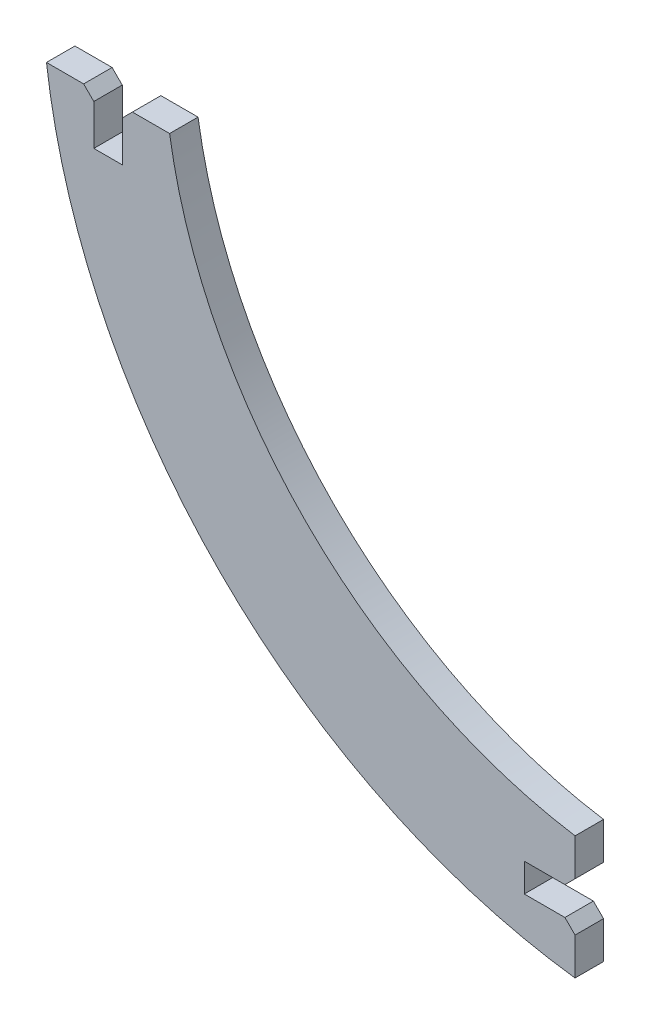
ISO-10303-21;
HEADER;
FILE_DESCRIPTION(('STEP AP214'),'2;1');
FILE_NAME('part.step','',(''),(''),'','','');
FILE_SCHEMA(('AUTOMOTIVE_DESIGN { 1 0 10303 214 1 1 1 1 }'));
ENDSEC;
DATA;
#1=APPLICATION_CONTEXT('core data for automotive mechanical design processes');
#2=APPLICATION_PROTOCOL_DEFINITION('international standard','automotive_design',2000,#1);
#3=PRODUCT_CONTEXT('',#1,'mechanical');
#4=PRODUCT('Part','Part','',(#3));
#5=PRODUCT_RELATED_PRODUCT_CATEGORY('part','',(#4));
#6=PRODUCT_DEFINITION_FORMATION('','',#4);
#7=PRODUCT_DEFINITION_CONTEXT('part definition',#1,'design');
#8=PRODUCT_DEFINITION('design','',#6,#7);
#9=PRODUCT_DEFINITION_SHAPE('','',#8);
#10=(LENGTH_UNIT() NAMED_UNIT(*) SI_UNIT(.MILLI.,.METRE.));
#11=(NAMED_UNIT(*) PLANE_ANGLE_UNIT() SI_UNIT($,.RADIAN.));
#12=(NAMED_UNIT(*) SI_UNIT($,.STERADIAN.) SOLID_ANGLE_UNIT());
#13=UNCERTAINTY_MEASURE_WITH_UNIT(LENGTH_MEASURE(1.E-05),#10,'distance_accuracy_value','');
#14=(GEOMETRIC_REPRESENTATION_CONTEXT(3) GLOBAL_UNCERTAINTY_ASSIGNED_CONTEXT((#13)) GLOBAL_UNIT_ASSIGNED_CONTEXT((#10,
#11,#12)) REPRESENTATION_CONTEXT('',''));
#15=CARTESIAN_POINT('',(0.,0.,0.));
#16=DIRECTION('',(0.,0.,1.));
#17=DIRECTION('',(1.,0.,0.));
#18=AXIS2_PLACEMENT_3D('',#15,#16,#17);
#19=CARTESIAN_POINT('',(-7.49999999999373,-75.9999999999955,-20.9830787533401));
#20=DIRECTION('',(-1.,0.,0.));
#21=DIRECTION('',(0.,-1.,0.));
#22=AXIS2_PLACEMENT_3D('',#19,#20,#21);
#23=PLANE('',#22);
#24=DIRECTION('',(0.,-1.,0.));
#25=VECTOR('',#24,1.);
#26=CARTESIAN_POINT('',(-7.49999999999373,-75.9999999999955,1.4));
#27=LINE('',#26,#25);
#28=CARTESIAN_POINT('',(-7.49999999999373,-63.4104418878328,1.4));
#29=VERTEX_POINT('',#28);
#30=CARTESIAN_POINT('',(-7.49999999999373,-67.0699231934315,1.4));
#31=VERTEX_POINT('',#30);
#32=EDGE_CURVE('E219',#29,#31,#27,.T.);
#33=ORIENTED_EDGE('',*,*,#32,.T.);
#34=DIRECTION('',(0.,0.,-1.));
#35=VECTOR('',#34,1.);
#36=CARTESIAN_POINT('',(-7.49999999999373,-67.0699231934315,-20.9830787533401));
#37=LINE('',#36,#35);
#38=CARTESIAN_POINT('',(-7.49999999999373,-67.0699231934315,-1.4));
#39=VERTEX_POINT('',#38);
#40=EDGE_CURVE('E264',#31,#39,#37,.T.);
#41=ORIENTED_EDGE('',*,*,#40,.T.);
#42=DIRECTION('',(0.,1.,0.));
#43=VECTOR('',#42,1.);
#44=CARTESIAN_POINT('',(-7.49999999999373,-75.9999999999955,-1.4));
#45=LINE('',#44,#43);
#46=CARTESIAN_POINT('',(-7.50000000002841,-63.4104418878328,-1.4));
#47=VERTEX_POINT('',#46);
#48=EDGE_CURVE('E218',#39,#47,#45,.T.);
#49=ORIENTED_EDGE('',*,*,#48,.T.);
#50=DIRECTION('',(0.,0.,1.));
#51=VECTOR('',#50,1.);
#52=CARTESIAN_POINT('',(-7.49999999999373,-63.4104418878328,-20.9830787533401));
#53=LINE('',#52,#51);
#54=EDGE_CURVE('E217',#47,#29,#53,.T.);
#55=ORIENTED_EDGE('',*,*,#54,.T.);
#56=EDGE_LOOP('',(#33,#41,#49,#55));
#57=FACE_BOUND('',#56,.T.);
#58=ADVANCED_FACE('F41',(#57),#23,.F.);
#59=CARTESIAN_POINT('',(-60.,-23.5,-20.9830787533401));
#60=DIRECTION('',(0.,-1.,0.));
#61=DIRECTION('',(0.,0.,-1.));
#62=AXIS2_PLACEMENT_3D('',#59,#60,#61);
#63=PLANE('',#62);
#64=DIRECTION('',(1.,0.,0.));
#65=VECTOR('',#64,1.);
#66=CARTESIAN_POINT('',(-60.,-23.5,1.4));
#67=LINE('',#66,#65);
#68=CARTESIAN_POINT('',(-59.5294044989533,-23.5,1.4));
#69=VERTEX_POINT('',#68);
#70=CARTESIAN_POINT('',(-55.8699231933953,-23.5,1.4));
#71=VERTEX_POINT('',#70);
#72=EDGE_CURVE('E232',#69,#71,#67,.T.);
#73=ORIENTED_EDGE('',*,*,#72,.T.);
#74=DIRECTION('',(0.,0.,-1.));
#75=VECTOR('',#74,1.);
#76=CARTESIAN_POINT('',(-55.8699231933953,-23.5,-20.9830787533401));
#77=LINE('',#76,#75);
#78=CARTESIAN_POINT('',(-55.8699231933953,-23.5,-1.4));
#79=VERTEX_POINT('',#78);
#80=EDGE_CURVE('E269',#71,#79,#77,.T.);
#81=ORIENTED_EDGE('',*,*,#80,.T.);
#82=DIRECTION('',(-1.,0.,0.));
#83=VECTOR('',#82,1.);
#84=CARTESIAN_POINT('',(-60.,-23.5,-1.4));
#85=LINE('',#84,#83);
#86=CARTESIAN_POINT('',(-59.5294044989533,-23.5,-1.4));
#87=VERTEX_POINT('',#86);
#88=EDGE_CURVE('E228',#79,#87,#85,.T.);
#89=ORIENTED_EDGE('',*,*,#88,.T.);
#90=DIRECTION('',(0.,0.,-1.));
#91=VECTOR('',#90,1.);
#92=CARTESIAN_POINT('',(-59.5294044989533,-23.5,1.4));
#93=LINE('',#92,#91);
#94=EDGE_CURVE('E205',#69,#87,#93,.T.);
#95=ORIENTED_EDGE('',*,*,#94,.F.);
#96=EDGE_LOOP('',(#73,#81,#89,#95));
#97=FACE_BOUND('',#96,.T.);
#98=ADVANCED_FACE('F332',(#97),#63,.F.);
#99=CARTESIAN_POINT('',(0.,-16.,1.4));
#100=DIRECTION('',(0.,0.,-1.));
#101=DIRECTION('',(-1.,0.,0.));
#102=AXIS2_PLACEMENT_3D('',#99,#100,#101);
#103=CYLINDRICAL_SURFACE('',#102,48.);
#104=DIRECTION('',(0.,0.,1.));
#105=VECTOR('',#104,1.);
#106=CARTESIAN_POINT('',(-47.4104418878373,-23.5,-20.9830787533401));
#107=LINE('',#106,#105);
#108=CARTESIAN_POINT('',(-47.4104418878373,-23.5,-1.4));
#109=VERTEX_POINT('',#108);
#110=CARTESIAN_POINT('',(-47.4104418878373,-23.5,1.4));
#111=VERTEX_POINT('',#110);
#112=EDGE_CURVE('E229',#109,#111,#107,.T.);
#113=ORIENTED_EDGE('',*,*,#112,.T.);
#114=CARTESIAN_POINT('',(0.,-16.,1.4));
#115=DIRECTION('',(0.,0.,1.));
#116=DIRECTION('',(1.,0.,0.));
#117=AXIS2_PLACEMENT_3D('',#114,#115,#116);
#118=CIRCLE('',#117,48.);
#119=EDGE_CURVE('E209',#111,#29,#118,.T.);
#120=ORIENTED_EDGE('',*,*,#119,.T.);
#121=ORIENTED_EDGE('',*,*,#54,.F.);
#122=CARTESIAN_POINT('',(0.,-16.,-1.4));
#123=DIRECTION('',(0.,0.,1.));
#124=DIRECTION('',(1.,0.,0.));
#125=AXIS2_PLACEMENT_3D('',#122,#123,#124);
#126=CIRCLE('',#125,48.);
#127=EDGE_CURVE('E213',#109,#47,#126,.T.);
#128=ORIENTED_EDGE('',*,*,#127,.F.);
#129=EDGE_LOOP('',(#113,#120,#121,#128));
#130=FACE_BOUND('',#129,.T.);
#131=ADVANCED_FACE('F284',(#130),#103,.F.);
#132=CARTESIAN_POINT('',(0.,-16.,1.4));
#133=DIRECTION('',(0.,0.,-1.));
#134=DIRECTION('',(-1.,0.,0.));
#135=AXIS2_PLACEMENT_3D('',#132,#133,#134);
#136=CYLINDRICAL_SURFACE('',#135,60.);
#137=CARTESIAN_POINT('',(0.,-16.,1.4));
#138=DIRECTION('',(0.,0.,1.));
#139=DIRECTION('',(1.,0.,0.));
#140=AXIS2_PLACEMENT_3D('',#137,#138,#139);
#141=CIRCLE('',#140,60.);
#142=CARTESIAN_POINT('',(-7.49999999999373,-75.5294044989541,1.4));
#143=VERTEX_POINT('',#142);
#144=EDGE_CURVE('E235',#69,#143,#141,.T.);
#145=ORIENTED_EDGE('',*,*,#144,.F.);
#146=ORIENTED_EDGE('',*,*,#94,.T.);
#147=CARTESIAN_POINT('',(0.,-16.,-1.4));
#148=DIRECTION('',(0.,0.,1.));
#149=DIRECTION('',(1.,0.,0.));
#150=AXIS2_PLACEMENT_3D('',#147,#148,#149);
#151=CIRCLE('',#150,60.);
#152=CARTESIAN_POINT('',(-7.49999999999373,-75.5294044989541,-1.4));
#153=VERTEX_POINT('',#152);
#154=EDGE_CURVE('E208',#87,#153,#151,.T.);
#155=ORIENTED_EDGE('',*,*,#154,.T.);
#156=DIRECTION('',(0.,0.,-1.));
#157=VECTOR('',#156,1.);
#158=CARTESIAN_POINT('',(-7.49999999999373,-75.5294044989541,1.4));
#159=LINE('',#158,#157);
#160=EDGE_CURVE('E210',#153,#143,#159,.F.);
#161=ORIENTED_EDGE('',*,*,#160,.T.);
#162=EDGE_LOOP('',(#145,#146,#155,#161));
#163=FACE_BOUND('',#162,.T.);
#164=ADVANCED_FACE('F308',(#163),#136,.T.);
#165=CARTESIAN_POINT('',(0.,-16.,-1.4));
#166=DIRECTION('',(0.,0.,1.));
#167=DIRECTION('',(1.,0.,0.));
#168=AXIS2_PLACEMENT_3D('',#165,#166,#167);
#169=PLANE('',#168);
#170=DIRECTION('',(-1.,0.,0.));
#171=VECTOR('',#170,1.);
#172=CARTESIAN_POINT('',(-7.49999999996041,-70.8699231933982,-1.4));
#173=LINE('',#172,#171);
#174=CARTESIAN_POINT('',(-8.4999999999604,-70.8699231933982,-1.4));
#175=VERTEX_POINT('',#174);
#176=CARTESIAN_POINT('',(-12.4999999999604,-70.8699231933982,-1.4));
#177=VERTEX_POINT('',#176);
#178=EDGE_CURVE('E181',#175,#177,#173,.T.);
#179=ORIENTED_EDGE('',*,*,#178,.F.);
#180=DIRECTION('',(-0.707106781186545,0.707106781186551,0.));
#181=VECTOR('',#180,1.);
#182=CARTESIAN_POINT('',(-7.49999999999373,-71.8699231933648,-1.4));
#183=LINE('',#182,#181);
#184=CARTESIAN_POINT('',(-7.49999999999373,-71.8699231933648,-1.4));
#185=VERTEX_POINT('',#184);
#186=EDGE_CURVE('E260',#175,#185,#183,.F.);
#187=ORIENTED_EDGE('',*,*,#186,.T.);
#188=EDGE_CURVE('E214',#153,#185,#45,.T.);
#189=ORIENTED_EDGE('',*,*,#188,.F.);
#190=ORIENTED_EDGE('',*,*,#154,.F.);
#191=ORIENTED_EDGE('',*,*,#88,.F.);
#192=DIRECTION('',(-0.707106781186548,0.707106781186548,0.));
#193=VECTOR('',#192,1.);
#194=CARTESIAN_POINT('',(-54.8699231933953,-24.5,-1.4));
#195=LINE('',#194,#193);
#196=CARTESIAN_POINT('',(-54.8699231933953,-24.5,-1.4));
#197=VERTEX_POINT('',#196);
#198=EDGE_CURVE('E257',#79,#197,#195,.F.);
#199=ORIENTED_EDGE('',*,*,#198,.T.);
#200=DIRECTION('',(0.,1.,0.));
#201=VECTOR('',#200,1.);
#202=CARTESIAN_POINT('',(-54.8699231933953,-28.5,-1.4));
#203=LINE('',#202,#201);
#204=CARTESIAN_POINT('',(-54.8699231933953,-28.5,-1.4));
#205=VERTEX_POINT('',#204);
#206=EDGE_CURVE('E196',#205,#197,#203,.T.);
#207=ORIENTED_EDGE('',*,*,#206,.F.);
#208=DIRECTION('',(-1.,0.,0.));
#209=VECTOR('',#208,1.);
#210=CARTESIAN_POINT('',(-54.8699231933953,-28.5,-1.4));
#211=LINE('',#210,#209);
#212=CARTESIAN_POINT('',(-52.0699231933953,-28.5,-1.4));
#213=VERTEX_POINT('',#212);
#214=EDGE_CURVE('E189',#213,#205,#211,.T.);
#215=ORIENTED_EDGE('',*,*,#214,.F.);
#216=DIRECTION('',(0.,-1.,0.));
#217=VECTOR('',#216,1.);
#218=CARTESIAN_POINT('',(-52.0699231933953,-28.5,-1.4));
#219=LINE('',#218,#217);
#220=CARTESIAN_POINT('',(-52.0699231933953,-24.5,-1.4));
#221=VERTEX_POINT('',#220);
#222=EDGE_CURVE('E187',#221,#213,#219,.T.);
#223=ORIENTED_EDGE('',*,*,#222,.F.);
#224=DIRECTION('',(-0.70710678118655,-0.707106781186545,0.));
#225=VECTOR('',#224,1.);
#226=CARTESIAN_POINT('',(-51.0699231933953,-23.5,-1.4));
#227=LINE('',#226,#225);
#228=CARTESIAN_POINT('',(-51.0699231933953,-23.5,-1.4));
#229=VERTEX_POINT('',#228);
#230=EDGE_CURVE('E57',#221,#229,#227,.F.);
#231=ORIENTED_EDGE('',*,*,#230,.T.);
#232=EDGE_CURVE('E225',#109,#229,#85,.T.);
#233=ORIENTED_EDGE('',*,*,#232,.F.);
#234=ORIENTED_EDGE('',*,*,#127,.T.);
#235=ORIENTED_EDGE('',*,*,#48,.F.);
#236=DIRECTION('',(0.707106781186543,0.707106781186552,0.));
#237=VECTOR('',#236,1.);
#238=CARTESIAN_POINT('',(-8.49999999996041,-68.0699231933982,-1.4));
#239=LINE('',#238,#237);
#240=CARTESIAN_POINT('',(-8.49999999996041,-68.0699231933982,-1.4));
#241=VERTEX_POINT('',#240);
#242=EDGE_CURVE('E180',#39,#241,#239,.F.);
#243=ORIENTED_EDGE('',*,*,#242,.T.);
#244=DIRECTION('',(1.,0.,0.));
#245=VECTOR('',#244,1.);
#246=CARTESIAN_POINT('',(-7.49999999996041,-68.0699231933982,-1.4));
#247=LINE('',#246,#245);
#248=CARTESIAN_POINT('',(-12.4999999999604,-68.0699231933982,-1.4));
#249=VERTEX_POINT('',#248);
#250=EDGE_CURVE('E165',#249,#241,#247,.T.);
#251=ORIENTED_EDGE('',*,*,#250,.F.);
#252=DIRECTION('',(0.,1.,0.));
#253=VECTOR('',#252,1.);
#254=CARTESIAN_POINT('',(-12.4999999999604,-68.0699231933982,-1.4));
#255=LINE('',#254,#253);
#256=EDGE_CURVE('E156',#177,#249,#255,.T.);
#257=ORIENTED_EDGE('',*,*,#256,.F.);
#258=EDGE_LOOP('',(#179,#187,#189,#190,#191,#199,#207,#215,#223,#231,#233,#234,#235,#243,#251,#257));
#259=FACE_BOUND('',#258,.T.);
#260=ADVANCED_FACE('F177',(#259),#169,.F.);
#261=CARTESIAN_POINT('',(0.,-16.,1.4));
#262=DIRECTION('',(0.,0.,1.));
#263=DIRECTION('',(1.,0.,0.));
#264=AXIS2_PLACEMENT_3D('',#261,#262,#263);
#265=PLANE('',#264);
#266=CARTESIAN_POINT('',(-7.49999999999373,-71.8699231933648,1.4));
#267=VERTEX_POINT('',#266);
#268=EDGE_CURVE('E223',#267,#143,#27,.T.);
#269=ORIENTED_EDGE('',*,*,#268,.F.);
#270=DIRECTION('',(0.707106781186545,-0.707106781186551,0.));
#271=VECTOR('',#270,1.);
#272=CARTESIAN_POINT('',(-31.6849615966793,-47.684961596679,1.4));
#273=LINE('',#272,#271);
#274=CARTESIAN_POINT('',(-8.4999999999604,-70.8699231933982,1.4));
#275=VERTEX_POINT('',#274);
#276=EDGE_CURVE('E252',#267,#275,#273,.F.);
#277=ORIENTED_EDGE('',*,*,#276,.T.);
#278=DIRECTION('',(1.,0.,0.));
#279=VECTOR('',#278,1.);
#280=CARTESIAN_POINT('',(-7.49999999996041,-70.8699231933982,1.4));
#281=LINE('',#280,#279);
#282=CARTESIAN_POINT('',(-12.4999999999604,-70.8699231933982,1.4));
#283=VERTEX_POINT('',#282);
#284=EDGE_CURVE('E175',#283,#275,#281,.T.);
#285=ORIENTED_EDGE('',*,*,#284,.F.);
#286=DIRECTION('',(0.,-1.,0.));
#287=VECTOR('',#286,1.);
#288=CARTESIAN_POINT('',(-12.4999999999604,-68.0699231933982,1.4));
#289=LINE('',#288,#287);
#290=CARTESIAN_POINT('',(-12.4999999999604,-68.0699231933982,1.4));
#291=VERTEX_POINT('',#290);
#292=EDGE_CURVE('E291',#291,#283,#289,.T.);
#293=ORIENTED_EDGE('',*,*,#292,.F.);
#294=DIRECTION('',(-1.,0.,0.));
#295=VECTOR('',#294,1.);
#296=CARTESIAN_POINT('',(-7.49999999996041,-68.0699231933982,1.4));
#297=LINE('',#296,#295);
#298=CARTESIAN_POINT('',(-8.49999999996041,-68.0699231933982,1.4));
#299=VERTEX_POINT('',#298);
#300=EDGE_CURVE('E174',#299,#291,#297,.T.);
#301=ORIENTED_EDGE('',*,*,#300,.F.);
#302=DIRECTION('',(-0.707106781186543,-0.707106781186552,0.));
#303=VECTOR('',#302,1.);
#304=CARTESIAN_POINT('',(21.7849615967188,-37.7849615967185,1.4));
#305=LINE('',#304,#303);
#306=EDGE_CURVE('E250',#299,#31,#305,.F.);
#307=ORIENTED_EDGE('',*,*,#306,.T.);
#308=ORIENTED_EDGE('',*,*,#32,.F.);
#309=ORIENTED_EDGE('',*,*,#119,.F.);
#310=CARTESIAN_POINT('',(-51.0699231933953,-23.5,1.4));
#311=VERTEX_POINT('',#310);
#312=EDGE_CURVE('E222',#311,#111,#67,.T.);
#313=ORIENTED_EDGE('',*,*,#312,.F.);
#314=DIRECTION('',(0.70710678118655,0.707106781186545,0.));
#315=VECTOR('',#314,1.);
#316=CARTESIAN_POINT('',(-21.7849615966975,5.78496159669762,1.4));
#317=LINE('',#316,#315);
#318=CARTESIAN_POINT('',(-52.0699231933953,-24.5,1.4));
#319=VERTEX_POINT('',#318);
#320=EDGE_CURVE('E246',#311,#319,#317,.F.);
#321=ORIENTED_EDGE('',*,*,#320,.T.);
#322=DIRECTION('',(0.,1.,0.));
#323=VECTOR('',#322,1.);
#324=CARTESIAN_POINT('',(-52.0699231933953,-28.5,1.4));
#325=LINE('',#324,#323);
#326=CARTESIAN_POINT('',(-52.0699231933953,-28.5,1.4));
#327=VERTEX_POINT('',#326);
#328=EDGE_CURVE('E198',#327,#319,#325,.T.);
#329=ORIENTED_EDGE('',*,*,#328,.F.);
#330=DIRECTION('',(1.,0.,0.));
#331=VECTOR('',#330,1.);
#332=CARTESIAN_POINT('',(-54.8699231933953,-28.5,1.4));
#333=LINE('',#332,#331);
#334=CARTESIAN_POINT('',(-54.8699231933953,-28.5,1.4));
#335=VERTEX_POINT('',#334);
#336=EDGE_CURVE('E166',#335,#327,#333,.T.);
#337=ORIENTED_EDGE('',*,*,#336,.F.);
#338=DIRECTION('',(0.,-1.,0.));
#339=VECTOR('',#338,1.);
#340=CARTESIAN_POINT('',(-54.8699231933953,-28.5,1.4));
#341=LINE('',#340,#339);
#342=CARTESIAN_POINT('',(-54.8699231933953,-24.5,1.4));
#343=VERTEX_POINT('',#342);
#344=EDGE_CURVE('E192',#343,#335,#341,.T.);
#345=ORIENTED_EDGE('',*,*,#344,.F.);
#346=DIRECTION('',(0.707106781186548,-0.707106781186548,0.));
#347=VECTOR('',#346,1.);
#348=CARTESIAN_POINT('',(-31.6849615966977,-47.6849615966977,1.4));
#349=LINE('',#348,#347);
#350=EDGE_CURVE('E248',#343,#71,#349,.F.);
#351=ORIENTED_EDGE('',*,*,#350,.T.);
#352=ORIENTED_EDGE('',*,*,#72,.F.);
#353=ORIENTED_EDGE('',*,*,#144,.T.);
#354=EDGE_LOOP('',(#269,#277,#285,#293,#301,#307,#308,#309,#313,#321,#329,#337,#345,#351,#352,#353));
#355=FACE_BOUND('',#354,.T.);
#356=ADVANCED_FACE('F279',(#355),#265,.T.);
#357=ORIENTED_EDGE('',*,*,#188,.T.);
#358=DIRECTION('',(0.,0.,1.));
#359=VECTOR('',#358,1.);
#360=CARTESIAN_POINT('',(-7.49999999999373,-71.8699231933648,-20.9830787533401));
#361=LINE('',#360,#359);
#362=EDGE_CURVE('E227',#185,#267,#361,.T.);
#363=ORIENTED_EDGE('',*,*,#362,.T.);
#364=ORIENTED_EDGE('',*,*,#268,.T.);
#365=ORIENTED_EDGE('',*,*,#160,.F.);
#366=EDGE_LOOP('',(#357,#363,#364,#365));
#367=FACE_BOUND('',#366,.T.);
#368=ADVANCED_FACE('F304',(#367),#23,.F.);
#369=ORIENTED_EDGE('',*,*,#232,.T.);
#370=DIRECTION('',(0.,0.,1.));
#371=VECTOR('',#370,1.);
#372=CARTESIAN_POINT('',(-51.0699231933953,-23.5,-20.9830787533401));
#373=LINE('',#372,#371);
#374=EDGE_CURVE('E50',#229,#311,#373,.T.);
#375=ORIENTED_EDGE('',*,*,#374,.T.);
#376=ORIENTED_EDGE('',*,*,#312,.T.);
#377=ORIENTED_EDGE('',*,*,#112,.F.);
#378=EDGE_LOOP('',(#369,#375,#376,#377));
#379=FACE_BOUND('',#378,.T.);
#380=ADVANCED_FACE('F274',(#379),#63,.F.);
#381=CARTESIAN_POINT('',(-54.8699231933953,-28.5,-7.13061951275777));
#382=DIRECTION('',(0.,-1.,0.));
#383=DIRECTION('',(1.,0.,0.));
#384=AXIS2_PLACEMENT_3D('',#381,#382,#383);
#385=PLANE('',#384);
#386=ORIENTED_EDGE('',*,*,#214,.T.);
#387=DIRECTION('',(0.,0.,1.));
#388=VECTOR('',#387,1.);
#389=CARTESIAN_POINT('',(-54.8699231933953,-28.5,-7.13061951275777));
#390=LINE('',#389,#388);
#391=EDGE_CURVE('E193',#205,#335,#390,.T.);
#392=ORIENTED_EDGE('',*,*,#391,.T.);
#393=ORIENTED_EDGE('',*,*,#336,.T.);
#394=DIRECTION('',(0.,0.,1.));
#395=VECTOR('',#394,1.);
#396=CARTESIAN_POINT('',(-52.0699231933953,-28.5,-7.13061951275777));
#397=LINE('',#396,#395);
#398=EDGE_CURVE('E190',#213,#327,#397,.T.);
#399=ORIENTED_EDGE('',*,*,#398,.F.);
#400=EDGE_LOOP('',(#386,#392,#393,#399));
#401=FACE_BOUND('',#400,.T.);
#402=ADVANCED_FACE('F325',(#401),#385,.F.);
#403=CARTESIAN_POINT('',(-54.8699231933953,-28.5,-7.13061951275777));
#404=DIRECTION('',(-1.,0.,0.));
#405=DIRECTION('',(0.,0.,1.));
#406=AXIS2_PLACEMENT_3D('',#403,#404,#405);
#407=PLANE('',#406);
#408=ORIENTED_EDGE('',*,*,#206,.T.);
#409=DIRECTION('',(0.,0.,1.));
#410=VECTOR('',#409,1.);
#411=CARTESIAN_POINT('',(-54.8699231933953,-24.5,-7.13061951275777));
#412=LINE('',#411,#410);
#413=EDGE_CURVE('E266',#197,#343,#412,.T.);
#414=ORIENTED_EDGE('',*,*,#413,.T.);
#415=ORIENTED_EDGE('',*,*,#344,.T.);
#416=ORIENTED_EDGE('',*,*,#391,.F.);
#417=EDGE_LOOP('',(#408,#414,#415,#416));
#418=FACE_BOUND('',#417,.T.);
#419=ADVANCED_FACE('F320',(#418),#407,.F.);
#420=CARTESIAN_POINT('',(-52.0699231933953,-28.5,-7.13061951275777));
#421=DIRECTION('',(1.,0.,0.));
#422=DIRECTION('',(0.,1.,0.));
#423=AXIS2_PLACEMENT_3D('',#420,#421,#422);
#424=PLANE('',#423);
#425=ORIENTED_EDGE('',*,*,#328,.T.);
#426=DIRECTION('',(0.,0.,-1.));
#427=VECTOR('',#426,1.);
#428=CARTESIAN_POINT('',(-52.0699231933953,-24.5,-7.13061951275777));
#429=LINE('',#428,#427);
#430=EDGE_CURVE('E11',#319,#221,#429,.T.);
#431=ORIENTED_EDGE('',*,*,#430,.T.);
#432=ORIENTED_EDGE('',*,*,#222,.T.);
#433=ORIENTED_EDGE('',*,*,#398,.T.);
#434=EDGE_LOOP('',(#425,#431,#432,#433));
#435=FACE_BOUND('',#434,.T.);
#436=ADVANCED_FACE('F452',(#435),#424,.F.);
#437=CARTESIAN_POINT('',(-7.49999999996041,-68.0699231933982,-7.13061951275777));
#438=DIRECTION('',(0.,1.,0.));
#439=DIRECTION('',(-1.,0.,0.));
#440=AXIS2_PLACEMENT_3D('',#437,#438,#439);
#441=PLANE('',#440);
#442=ORIENTED_EDGE('',*,*,#250,.T.);
#443=DIRECTION('',(0.,0.,1.));
#444=VECTOR('',#443,1.);
#445=CARTESIAN_POINT('',(-8.49999999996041,-68.0699231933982,-7.13061951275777));
#446=LINE('',#445,#444);
#447=EDGE_CURVE('E262',#241,#299,#446,.T.);
#448=ORIENTED_EDGE('',*,*,#447,.T.);
#449=ORIENTED_EDGE('',*,*,#300,.T.);
#450=DIRECTION('',(0.,0.,1.));
#451=VECTOR('',#450,1.);
#452=CARTESIAN_POINT('',(-12.4999999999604,-68.0699231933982,-7.13061951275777));
#453=LINE('',#452,#451);
#454=EDGE_CURVE('E160',#249,#291,#453,.T.);
#455=ORIENTED_EDGE('',*,*,#454,.F.);
#456=EDGE_LOOP('',(#442,#448,#449,#455));
#457=FACE_BOUND('',#456,.T.);
#458=ADVANCED_FACE('F170',(#457),#441,.F.);
#459=CARTESIAN_POINT('',(-7.49999999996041,-70.8699231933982,-7.13061951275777));
#460=DIRECTION('',(0.,-1.,0.));
#461=DIRECTION('',(1.,0.,0.));
#462=AXIS2_PLACEMENT_3D('',#459,#460,#461);
#463=PLANE('',#462);
#464=ORIENTED_EDGE('',*,*,#284,.T.);
#465=DIRECTION('',(0.,0.,-1.));
#466=VECTOR('',#465,1.);
#467=CARTESIAN_POINT('',(-8.4999999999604,-70.8699231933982,-7.13061951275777));
#468=LINE('',#467,#466);
#469=EDGE_CURVE('E254',#275,#175,#468,.T.);
#470=ORIENTED_EDGE('',*,*,#469,.T.);
#471=ORIENTED_EDGE('',*,*,#178,.T.);
#472=DIRECTION('',(0.,0.,1.));
#473=VECTOR('',#472,1.);
#474=CARTESIAN_POINT('',(-12.4999999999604,-70.8699231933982,-7.13061951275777));
#475=LINE('',#474,#473);
#476=EDGE_CURVE('E162',#177,#283,#475,.T.);
#477=ORIENTED_EDGE('',*,*,#476,.T.);
#478=EDGE_LOOP('',(#464,#470,#471,#477));
#479=FACE_BOUND('',#478,.T.);
#480=ADVANCED_FACE('F296',(#479),#463,.F.);
#481=CARTESIAN_POINT('',(-12.4999999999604,-68.0699231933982,-7.13061951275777));
#482=DIRECTION('',(-1.,0.,0.));
#483=DIRECTION('',(0.,0.,1.));
#484=AXIS2_PLACEMENT_3D('',#481,#482,#483);
#485=PLANE('',#484);
#486=ORIENTED_EDGE('',*,*,#256,.T.);
#487=ORIENTED_EDGE('',*,*,#454,.T.);
#488=ORIENTED_EDGE('',*,*,#292,.T.);
#489=ORIENTED_EDGE('',*,*,#476,.F.);
#490=EDGE_LOOP('',(#486,#487,#488,#489));
#491=FACE_BOUND('',#490,.T.);
#492=ADVANCED_FACE('F158',(#491),#485,.F.);
#493=CARTESIAN_POINT('',(-7.49999999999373,-71.8699231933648,-20.9830787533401));
#494=DIRECTION('',(-0.707106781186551,-0.707106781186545,0.));
#495=DIRECTION('',(0.,0.,1.));
#496=AXIS2_PLACEMENT_3D('',#493,#494,#495);
#497=PLANE('',#496);
#498=ORIENTED_EDGE('',*,*,#186,.F.);
#499=ORIENTED_EDGE('',*,*,#469,.F.);
#500=ORIENTED_EDGE('',*,*,#276,.F.);
#501=ORIENTED_EDGE('',*,*,#362,.F.);
#502=EDGE_LOOP('',(#498,#499,#500,#501));
#503=FACE_BOUND('',#502,.T.);
#504=ADVANCED_FACE('F302',(#503),#497,.F.);
#505=CARTESIAN_POINT('',(-8.49999999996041,-68.0699231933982,-7.13061951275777));
#506=DIRECTION('',(-0.707106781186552,0.707106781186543,0.));
#507=DIRECTION('',(0.,0.,1.));
#508=AXIS2_PLACEMENT_3D('',#505,#506,#507);
#509=PLANE('',#508);
#510=ORIENTED_EDGE('',*,*,#242,.F.);
#511=ORIENTED_EDGE('',*,*,#40,.F.);
#512=ORIENTED_EDGE('',*,*,#306,.F.);
#513=ORIENTED_EDGE('',*,*,#447,.F.);
#514=EDGE_LOOP('',(#510,#511,#512,#513));
#515=FACE_BOUND('',#514,.T.);
#516=ADVANCED_FACE('F289',(#515),#509,.F.);
#517=CARTESIAN_POINT('',(-54.8699231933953,-24.5,-7.13061951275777));
#518=DIRECTION('',(-0.707106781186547,-0.707106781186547,0.));
#519=DIRECTION('',(0.,0.,1.));
#520=AXIS2_PLACEMENT_3D('',#517,#518,#519);
#521=PLANE('',#520);
#522=ORIENTED_EDGE('',*,*,#198,.F.);
#523=ORIENTED_EDGE('',*,*,#80,.F.);
#524=ORIENTED_EDGE('',*,*,#350,.F.);
#525=ORIENTED_EDGE('',*,*,#413,.F.);
#526=EDGE_LOOP('',(#522,#523,#524,#525));
#527=FACE_BOUND('',#526,.T.);
#528=ADVANCED_FACE('F317',(#527),#521,.F.);
#529=CARTESIAN_POINT('',(-51.0699231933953,-23.5,-20.9830787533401));
#530=DIRECTION('',(0.707106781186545,-0.70710678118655,0.));
#531=DIRECTION('',(0.,0.,1.));
#532=AXIS2_PLACEMENT_3D('',#529,#530,#531);
#533=PLANE('',#532);
#534=ORIENTED_EDGE('',*,*,#230,.F.);
#535=ORIENTED_EDGE('',*,*,#430,.F.);
#536=ORIENTED_EDGE('',*,*,#320,.F.);
#537=ORIENTED_EDGE('',*,*,#374,.F.);
#538=EDGE_LOOP('',(#534,#535,#536,#537));
#539=FACE_BOUND('',#538,.T.);
#540=ADVANCED_FACE('F44',(#539),#533,.F.);
#541=CLOSED_SHELL('',(#58,#98,#131,#164,#260,#356,#368,#380,#402,#419,#436,#458,#480,#492,#504,
#516,#528,#540));
#542=MANIFOLD_SOLID_BREP('B2',#541);
#543=ADVANCED_BREP_SHAPE_REPRESENTATION('',(#18,#542),#14);
#544=SHAPE_DEFINITION_REPRESENTATION(#9,#543);
ENDSEC;
END-ISO-10303-21;
